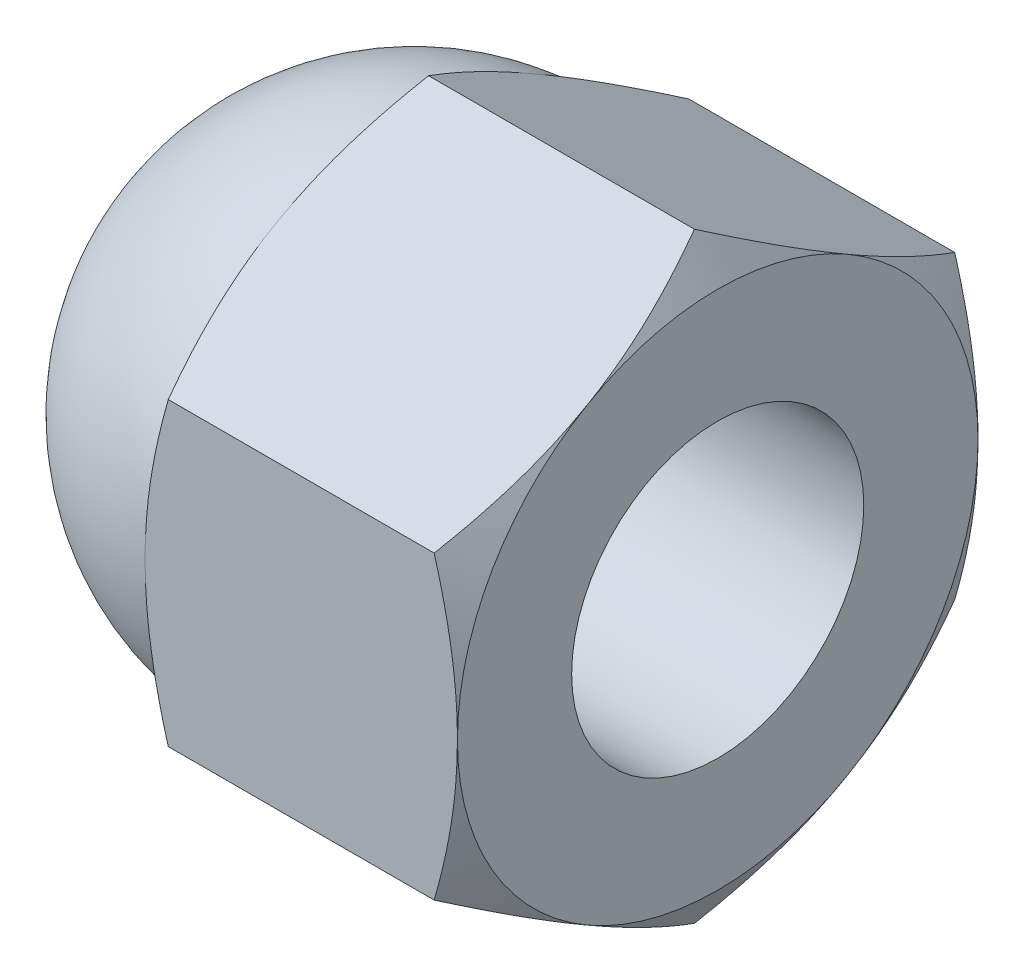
ISO-10303-21;
HEADER;
FILE_DESCRIPTION(('STEP AP214'),'2;1');
FILE_NAME('part.step','',(''),(''),'','','');
FILE_SCHEMA(('AUTOMOTIVE_DESIGN { 1 0 10303 214 1 1 1 1 }'));
ENDSEC;
DATA;
#1=APPLICATION_CONTEXT('core data for automotive mechanical design processes');
#2=APPLICATION_PROTOCOL_DEFINITION('international standard','automotive_design',2000,#1);
#3=PRODUCT_CONTEXT('',#1,'mechanical');
#4=PRODUCT('Part','Part','',(#3));
#5=PRODUCT_RELATED_PRODUCT_CATEGORY('part','',(#4));
#6=PRODUCT_DEFINITION_FORMATION('','',#4);
#7=PRODUCT_DEFINITION_CONTEXT('part definition',#1,'design');
#8=PRODUCT_DEFINITION('design','',#6,#7);
#9=PRODUCT_DEFINITION_SHAPE('','',#8);
#10=(LENGTH_UNIT() NAMED_UNIT(*) SI_UNIT(.MILLI.,.METRE.));
#11=(NAMED_UNIT(*) PLANE_ANGLE_UNIT() SI_UNIT($,.RADIAN.));
#12=(NAMED_UNIT(*) SI_UNIT($,.STERADIAN.) SOLID_ANGLE_UNIT());
#13=UNCERTAINTY_MEASURE_WITH_UNIT(LENGTH_MEASURE(1.E-05),#10,'distance_accuracy_value','');
#14=(GEOMETRIC_REPRESENTATION_CONTEXT(3) GLOBAL_UNCERTAINTY_ASSIGNED_CONTEXT((#13)) GLOBAL_UNIT_ASSIGNED_CONTEXT((#10,
#11,#12)) REPRESENTATION_CONTEXT('',''));
#15=CARTESIAN_POINT('',(0.,0.,0.));
#16=DIRECTION('',(0.,0.,1.));
#17=DIRECTION('',(1.,0.,0.));
#18=AXIS2_PLACEMENT_3D('',#15,#16,#17);
#19=CARTESIAN_POINT('',(-10.8,-5.19615242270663,9.));
#20=DIRECTION('',(0.,0.,1.));
#21=DIRECTION('',(0.,-1.,0.));
#22=AXIS2_PLACEMENT_3D('',#19,#20,#21);
#23=PLANE('',#22);
#24=CARTESIAN_POINT('',(-10.5,0.,9.));
#25=VERTEX_POINT('',#24);
#26=VERTEX_LOOP('',#25);
#27=FACE_BOUND('',#26,.T.);
#28=DIRECTION('',(1.,0.,0.));
#29=VECTOR('',#28,1.);
#30=CARTESIAN_POINT('',(-10.8,-5.19615242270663,9.));
#31=LINE('',#30,#29);
#32=CARTESIAN_POINT('',(-9.99615242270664,-5.19615242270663,9.));
#33=VERTEX_POINT('',#32);
#34=CARTESIAN_POINT('',(-0.803847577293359,-5.19615242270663,9.));
#35=VERTEX_POINT('',#34);
#36=EDGE_CURVE('E236',#33,#35,#31,.T.);
#37=ORIENTED_EDGE('',*,*,#36,.T.);
#38=CARTESIAN_POINT('',(-4.4134221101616,-14.0011345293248,9.));
#39=CARTESIAN_POINT('',(-4.22232611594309,-13.6075558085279,9.));
#40=CARTESIAN_POINT('',(-4.03305033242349,-13.2130780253,9.));
#41=CARTESIAN_POINT('',(-3.65916247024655,-12.421846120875,9.));
#42=CARTESIAN_POINT('',(-3.47455111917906,-12.0250916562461,9.));
#43=CARTESIAN_POINT('',(-3.11009664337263,-11.226806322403,9.));
#44=CARTESIAN_POINT('',(-2.93028454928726,-10.8252612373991,9.));
#45=CARTESIAN_POINT('',(-2.57796467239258,-10.0189911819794,9.));
#46=CARTESIAN_POINT('',(-2.40545654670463,-9.61426636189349,9.));
#47=CARTESIAN_POINT('',(-2.06431414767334,-8.78801484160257,9.));
#48=CARTESIAN_POINT('',(-1.89597894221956,-8.36636398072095,9.));
#49=CARTESIAN_POINT('',(-1.5719434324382,-7.51814721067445,9.));
#50=CARTESIAN_POINT('',(-1.41624453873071,-7.09158075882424,9.));
#51=CARTESIAN_POINT('',(-1.12153564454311,-6.23363207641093,9.));
#52=CARTESIAN_POINT('',(-0.982492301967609,-5.80226142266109,9.));
#53=CARTESIAN_POINT('',(-0.725524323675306,-4.93334937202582,9.));
#54=CARTESIAN_POINT('',(-0.607593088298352,-4.49580994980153,9.));
#55=CARTESIAN_POINT('',(-0.399083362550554,-3.61654683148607,9.));
#56=CARTESIAN_POINT('',(-0.308362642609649,-3.17485779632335,9.));
#57=CARTESIAN_POINT('',(-0.196624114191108,-2.50826884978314,9.));
#58=CARTESIAN_POINT('',(-0.163433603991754,-2.28538137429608,9.));
#59=CARTESIAN_POINT('',(-0.105816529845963,-1.83848377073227,9.));
#60=CARTESIAN_POINT('',(-0.0813891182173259,-1.6144737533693,9.));
#61=CARTESIAN_POINT('',(-0.0420936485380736,-1.1685777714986,9.));
#62=CARTESIAN_POINT('',(-0.0271042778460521,-0.946702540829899,9.));
#63=CARTESIAN_POINT('',(-0.00652388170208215,-0.502516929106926,9.));
#64=CARTESIAN_POINT('',(-0.000932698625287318,-0.280206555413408,9.));
#65=CARTESIAN_POINT('',(0.000717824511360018,0.164455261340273,9.));
#66=CARTESIAN_POINT('',(-0.00322301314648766,0.386806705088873,9.));
#67=CARTESIAN_POINT('',(-0.0205399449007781,0.831144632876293,9.));
#68=CARTESIAN_POINT('',(-0.0339165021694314,1.05313109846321,9.));
#69=CARTESIAN_POINT('',(-0.076994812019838,1.5851088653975,9.));
#70=CARTESIAN_POINT('',(-0.111088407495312,1.89475213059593,9.));
#71=CARTESIAN_POINT('',(-0.195786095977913,2.5117562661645,9.));
#72=CARTESIAN_POINT('',(-0.246392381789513,2.81911682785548,9.));
#73=CARTESIAN_POINT('',(-0.420297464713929,3.73739525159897,9.));
#74=CARTESIAN_POINT('',(-0.565653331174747,4.34419200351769,9.));
#75=CARTESIAN_POINT('',(-0.818016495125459,5.25198296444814,9.));
#76=CARTESIAN_POINT('',(-0.909110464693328,5.55767115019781,9.));
#77=CARTESIAN_POINT('',(-1.10081926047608,6.16607684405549,9.));
#78=CARTESIAN_POINT('',(-1.20143416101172,6.46879432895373,9.));
#79=CARTESIAN_POINT('',(-1.41056498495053,7.07135954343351,9.));
#80=CARTESIAN_POINT('',(-1.51907850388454,7.37120811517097,9.));
#81=CARTESIAN_POINT('',(-1.74272341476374,7.96841034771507,9.));
#82=CARTESIAN_POINT('',(-1.85785463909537,8.26576407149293,9.));
#83=CARTESIAN_POINT('',(-2.1875087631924,9.09420249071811,9.));
#84=CARTESIAN_POINT('',(-2.40816844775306,9.62284326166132,9.));
#85=CARTESIAN_POINT('',(-2.86247270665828,10.6745366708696,9.));
#86=CARTESIAN_POINT('',(-3.09611884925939,11.1975886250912,9.));
#87=CARTESIAN_POINT('',(-3.57318349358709,12.2394615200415,9.));
#88=CARTESIAN_POINT('',(-3.81660596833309,12.7582806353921,9.));
#89=CARTESIAN_POINT('',(-4.31078359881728,13.7923736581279,9.));
#90=CARTESIAN_POINT('',(-4.56153842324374,14.3076477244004,9.));
#91=CARTESIAN_POINT('',(-5.06914652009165,15.3362447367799,9.));
#92=CARTESIAN_POINT('',(-5.32600925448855,15.8495630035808,9.));
#93=CARTESIAN_POINT('',(-5.84421102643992,16.8739372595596,9.));
#94=CARTESIAN_POINT('',(-6.10555010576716,17.3849932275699,9.));
#95=CARTESIAN_POINT('',(-6.63173457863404,18.4051413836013,9.));
#96=CARTESIAN_POINT('',(-6.89657912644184,18.9142340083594,9.));
#97=CARTESIAN_POINT('',(-7.42915867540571,19.93090593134,9.));
#98=CARTESIAN_POINT('',(-7.69689368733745,20.4384852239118,8.99999999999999));
#99=CARTESIAN_POINT('',(-8.44379482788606,21.8465462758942,8.99999999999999));
#100=CARTESIAN_POINT('',(-8.92550336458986,22.7456791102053,8.99999999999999));
#101=CARTESIAN_POINT('',(-9.89429519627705,24.5411156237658,8.99999999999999));
#102=CARTESIAN_POINT('',(-10.3813788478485,25.4374191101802,8.99999999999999));
#103=CARTESIAN_POINT('',(-11.3578751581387,27.2248180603,8.99999999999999));
#104=CARTESIAN_POINT('',(-11.8472743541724,28.1159208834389,8.99999999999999));
#105=CARTESIAN_POINT('',(-12.5836208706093,29.4512869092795,8.99999999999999));
#106=CARTESIAN_POINT('',(-12.8294342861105,29.896176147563,8.99999999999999));
#107=CARTESIAN_POINT('',(-13.3217320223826,30.7855826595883,8.99999999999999));
#108=CARTESIAN_POINT('',(-13.5682163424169,31.2300999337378,9.));
#109=CARTESIAN_POINT('',(-13.8149939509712,31.6744543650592,9.));
#110=B_SPLINE_CURVE_WITH_KNOTS('',3,(#38,#39,#40,#41,#42,#43,#44,#45,#46,#47,#48,#49,#50,#51,
#52,#53,#54,#55,#56,#57,#58,#59,#60,#61,#62,#63,#64,#65,#66,#67,#68,#69,#70,#71,#72,#73,#74,#75,
#76,#77,#78,#79,#80,#81,#82,#83,#84,#85,#86,#87,#88,#89,#90,#91,#92,#93,#94,#95,#96,#97,#98,#99,
#100,#101,#102,#103,#104,#105,#106,#107,#108,#109),.UNSPECIFIED.,.F.,.F.,(4,2,2,2,2,2,2,2,2,2,2,
2,2,2,2,2,2,2,2,2,2,2,2,2,2,2,2,2,2,2,2,2,2,2,2,4),(0.,1.31256945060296,2.62534239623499,
3.94518469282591,5.26496496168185,6.62684143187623,7.98886972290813,9.3481241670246,
10.7069529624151,12.0585501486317,12.734440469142,13.4102653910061,14.077216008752,
14.744155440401,15.4111073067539,16.0780919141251,17.0121094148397,17.9462509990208,
19.815487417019,20.7723233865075,21.7291668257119,22.6857201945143,23.6422493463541,
25.3605176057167,27.0789938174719,28.7981756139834,30.5172798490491,32.2392474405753,
33.9612311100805,35.6828066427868,37.4043885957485,40.46448200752,43.5247796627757,
46.5747193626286,48.0995651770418,49.6244093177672),.UNSPECIFIED.);
#111=CARTESIAN_POINT('',(0.,0.,9.));
#112=VERTEX_POINT('',#111);
#113=EDGE_CURVE('E334',#35,#112,#110,.T.);
#114=ORIENTED_EDGE('',*,*,#113,.T.);
#115=CARTESIAN_POINT('',(-0.803847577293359,5.19615242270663,9.));
#116=VERTEX_POINT('',#115);
#117=EDGE_CURVE('E167',#112,#116,#110,.T.);
#118=ORIENTED_EDGE('',*,*,#117,.T.);
#119=DIRECTION('',(1.,0.,0.));
#120=VECTOR('',#119,1.);
#121=CARTESIAN_POINT('',(-10.8,5.19615242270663,9.));
#122=LINE('',#121,#120);
#123=CARTESIAN_POINT('',(-9.99615242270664,5.19615242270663,9.));
#124=VERTEX_POINT('',#123);
#125=EDGE_CURVE('E220',#124,#116,#122,.T.);
#126=ORIENTED_EDGE('',*,*,#125,.F.);
#127=CARTESIAN_POINT('',(-6.34439619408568,-14.0879095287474,9.));
#128=CARTESIAN_POINT('',(-6.53616569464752,-13.693655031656,9.));
#129=CARTESIAN_POINT('',(-6.72613358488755,-13.2985092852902,9.));
#130=CARTESIAN_POINT('',(-7.10145525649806,-12.5059616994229,9.));
#131=CARTESIAN_POINT('',(-7.28680833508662,-12.1085595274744,9.));
#132=CARTESIAN_POINT('',(-7.65279398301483,-11.3090404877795,9.));
#133=CARTESIAN_POINT('',(-7.83339647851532,-10.9069098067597,9.));
#134=CARTESIAN_POINT('',(-8.18738125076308,-10.0994948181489,9.));
#135=CARTESIAN_POINT('',(-8.36076386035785,-9.69421065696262,9.));
#136=CARTESIAN_POINT('',(-8.70398931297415,-8.86637898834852,9.));
#137=CARTESIAN_POINT('',(-8.87352564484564,-8.44370370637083,9.));
#138=CARTESIAN_POINT('',(-9.20008012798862,-7.59345787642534,9.));
#139=CARTESIAN_POINT('',(-9.35709689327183,-7.16588679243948,9.));
#140=CARTESIAN_POINT('',(-9.65458596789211,-6.305922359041,9.));
#141=CARTESIAN_POINT('',(-9.7950906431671,-5.87354032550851,9.));
#142=CARTESIAN_POINT('',(-10.0551354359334,-5.00259089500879,9.));
#143=CARTESIAN_POINT('',(-10.1746820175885,-4.56402545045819,9.));
#144=CARTESIAN_POINT('',(-10.3865251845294,-3.68279147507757,9.));
#145=CARTESIAN_POINT('',(-10.478970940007,-3.24015978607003,9.));
#146=CARTESIAN_POINT('',(-10.5933665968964,-2.5720797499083,9.));
#147=CARTESIAN_POINT('',(-10.6274544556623,-2.34868256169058,9.));
#148=CARTESIAN_POINT('',(-10.6868739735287,-1.90073399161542,9.));
#149=CARTESIAN_POINT('',(-10.71220648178,-1.67618272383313,9.));
#150=CARTESIAN_POINT('',(-10.753285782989,-1.22921881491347,9.));
#151=CARTESIAN_POINT('',(-10.7691558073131,-1.00681754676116,9.));
#152=CARTESIAN_POINT('',(-10.7914704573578,-0.561542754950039,9.));
#153=CARTESIAN_POINT('',(-10.7979152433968,-0.338669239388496,9.));
#154=CARTESIAN_POINT('',(-10.8012251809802,0.107152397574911,9.));
#155=CARTESIAN_POINT('',(-10.7980902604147,0.330100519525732,9.));
#156=CARTESIAN_POINT('',(-10.7823189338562,0.775663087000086,9.));
#157=CARTESIAN_POINT('',(-10.7696820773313,0.99827751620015,9.));
#158=CARTESIAN_POINT('',(-10.7284769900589,1.52928538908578,9.));
#159=CARTESIAN_POINT('',(-10.695623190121,1.83735365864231,9.));
#160=CARTESIAN_POINT('',(-10.6134808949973,2.45127496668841,9.));
#161=CARTESIAN_POINT('',(-10.5641902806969,2.75712771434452,9.));
#162=CARTESIAN_POINT('',(-10.3942711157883,3.6709642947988,9.));
#163=CARTESIAN_POINT('',(-10.2516229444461,4.27491194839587,9.));
#164=CARTESIAN_POINT('',(-10.0032990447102,5.17834875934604,9.));
#165=CARTESIAN_POINT('',(-9.913584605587,5.48249505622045,9.));
#166=CARTESIAN_POINT('',(-9.72460437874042,6.08783493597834,9.));
#167=CARTESIAN_POINT('',(-9.62533851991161,6.38902849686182,9.));
#168=CARTESIAN_POINT('',(-9.41886770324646,6.98855625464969,9.));
#169=CARTESIAN_POINT('',(-9.31166511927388,7.28689127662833,9.));
#170=CARTESIAN_POINT('',(-9.09060569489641,7.88107084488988,9.));
#171=CARTESIAN_POINT('',(-8.97674899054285,8.17691544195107,9.));
#172=CARTESIAN_POINT('',(-8.66908665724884,8.95441621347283,9.));
#173=CARTESIAN_POINT('',(-8.47061022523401,9.43422210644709,9.));
#174=CARTESIAN_POINT('',(-8.06247010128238,10.389068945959,9.));
#175=CARTESIAN_POINT('',(-7.85280529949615,10.864109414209,9.));
#176=CARTESIAN_POINT('',(-7.42486425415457,11.8104820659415,9.));
#177=CARTESIAN_POINT('',(-7.20658504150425,12.2818129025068,9.));
#178=CARTESIAN_POINT('',(-6.76341771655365,13.2213264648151,9.));
#179=CARTESIAN_POINT('',(-6.53852984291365,13.689509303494,9.));
#180=CARTESIAN_POINT('',(-6.08320833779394,14.6240308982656,9.));
#181=CARTESIAN_POINT('',(-5.85276692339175,15.0903658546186,9.));
#182=CARTESIAN_POINT('',(-5.38771687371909,16.020954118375,9.));
#183=CARTESIAN_POINT('',(-5.15310820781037,16.4852074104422,9.));
#184=CARTESIAN_POINT('',(-4.68057121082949,17.411902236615,9.));
#185=CARTESIAN_POINT('',(-4.44264355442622,17.8743441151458,9.));
#186=CARTESIAN_POINT('',(-3.96402956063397,18.7977988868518,9.));
#187=CARTESIAN_POINT('',(-3.72334321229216,19.2588117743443,9.));
#188=CARTESIAN_POINT('',(-3.04699164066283,20.5465513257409,9.));
#189=CARTESIAN_POINT('',(-2.60879583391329,21.3719486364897,8.99999999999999));
#190=CARTESIAN_POINT('',(-1.72705096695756,23.0199314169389,8.99999999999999));
#191=CARTESIAN_POINT('',(-1.28350160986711,23.8425167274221,8.99999999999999));
#192=CARTESIAN_POINT('',(-0.393801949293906,25.4829119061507,8.99999999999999));
#193=CARTESIAN_POINT('',(0.0523356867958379,26.3007286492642,8.99999999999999));
#194=CARTESIAN_POINT('',(0.723826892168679,27.5261617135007,8.99999999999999));
#195=CARTESIAN_POINT('',(0.948029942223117,27.9344093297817,8.99999999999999));
#196=CARTESIAN_POINT('',(1.39711875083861,28.7505282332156,8.99999999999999));
#197=CARTESIAN_POINT('',(1.62200450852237,29.1583995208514,9.));
#198=CARTESIAN_POINT('',(1.84718982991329,29.5661053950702,9.));
#199=B_SPLINE_CURVE_WITH_KNOTS('',3,(#127,#128,#129,#130,#131,#132,#133,#134,#135,#136,#137,
#138,#139,#140,#141,#142,#143,#144,#145,#146,#147,#148,#149,#150,#151,#152,#153,#154,#155,#156,
#157,#158,#159,#160,#161,#162,#163,#164,#165,#166,#167,#168,#169,#170,#171,#172,#173,#174,#175,
#176,#177,#178,#179,#180,#181,#182,#183,#184,#185,#186,#187,#188,#189,#190,#191,#192,#193,#194,
#195,#196,#197,#198),.UNSPECIFIED.,.F.,.F.,(4,2,2,2,2,2,2,2,2,2,2,2,2,2,2,2,2,2,2,2,2,2,2,2,2,2,
2,2,2,2,2,2,2,2,2,4),(0.,1.31527562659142,2.63075034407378,3.95316726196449,5.27552314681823,
6.64159484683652,8.0078175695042,9.37131599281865,10.7343931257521,12.0898202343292,
12.7676245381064,13.445363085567,14.1140707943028,14.7827671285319,15.4514684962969,
16.1202015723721,17.0491251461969,17.9781685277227,19.8371982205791,20.7884210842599,
21.7396510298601,22.6905976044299,23.6415247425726,25.1990257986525,26.7566816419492,
28.3148791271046,29.8730204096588,31.4334894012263,32.993969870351,34.5541376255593,
36.1143115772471,38.9177907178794,41.7214260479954,44.5161918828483,45.9134738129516,
47.3107539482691),.UNSPECIFIED.);
#200=CARTESIAN_POINT('',(-10.8,0.,9.));
#201=VERTEX_POINT('',#200);
#202=EDGE_CURVE('E290',#124,#201,#199,.F.);
#203=ORIENTED_EDGE('',*,*,#202,.T.);
#204=EDGE_CURVE('E286',#201,#33,#199,.F.);
#205=ORIENTED_EDGE('',*,*,#204,.T.);
#206=EDGE_LOOP('',(#37,#114,#118,#126,#203,#205));
#207=FACE_BOUND('',#206,.T.);
#208=ADVANCED_FACE('F17',(#27,#207),#23,.T.);
#209=CARTESIAN_POINT('',(-10.8,5.19615242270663,9.));
#210=DIRECTION('',(0.,0.866025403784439,0.5));
#211=DIRECTION('',(0.,-0.5,0.866025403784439));
#212=AXIS2_PLACEMENT_3D('',#209,#210,#211);
#213=PLANE('',#212);
#214=CARTESIAN_POINT('',(-10.5,7.79422863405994,4.5));
#215=VERTEX_POINT('',#214);
#216=VERTEX_LOOP('',#215);
#217=FACE_BOUND('',#216,.T.);
#218=ORIENTED_EDGE('',*,*,#125,.T.);
#219=CARTESIAN_POINT('',(-0.803914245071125,5.19603695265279,9.0002));
#220=CARTESIAN_POINT('',(-0.73798200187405,5.31024090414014,8.80239295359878));
#221=CARTESIAN_POINT('',(-0.67504140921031,5.42489028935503,8.60381439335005));
#222=CARTESIAN_POINT('',(-0.555968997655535,5.65512011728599,8.20504463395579));
#223=CARTESIAN_POINT('',(-0.499840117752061,5.77070093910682,8.00485277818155));
#224=CARTESIAN_POINT('',(-0.39515196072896,6.00300811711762,7.6024849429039));
#225=CARTESIAN_POINT('',(-0.346610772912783,6.11973652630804,7.4003054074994));
#226=CARTESIAN_POINT('',(-0.258148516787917,6.35398725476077,6.99457124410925));
#227=CARTESIAN_POINT('',(-0.218225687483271,6.47150940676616,6.79101690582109));
#228=CARTESIAN_POINT('',(-0.148684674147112,6.70436794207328,6.38769409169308));
#229=CARTESIAN_POINT('',(-0.118837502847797,6.81968712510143,6.18795540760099));
#230=CARTESIAN_POINT('',(-0.0687933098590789,7.05084147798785,5.787584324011));
#231=CARTESIAN_POINT('',(-0.0485954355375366,7.16667660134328,5.58695200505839));
#232=CARTESIAN_POINT('',(-0.0183543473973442,7.39854776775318,5.18533936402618));
#233=CARTESIAN_POINT('',(-0.00829960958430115,7.51458343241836,4.98435969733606));
#234=CARTESIAN_POINT('',(0.00143766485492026,7.74676155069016,4.58221540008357));
#235=CARTESIAN_POINT('',(0.00112052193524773,7.86290400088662,4.38105077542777));
#236=CARTESIAN_POINT('',(-0.00916395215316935,8.08003584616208,4.00496738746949));
#237=CARTESIAN_POINT('',(-0.0178767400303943,8.18104055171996,3.8300221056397));
#238=CARTESIAN_POINT('',(-0.0429773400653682,8.38281337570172,3.48054132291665));
#239=CARTESIAN_POINT('',(-0.0593656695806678,8.4835814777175,3.30600585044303));
#240=CARTESIAN_POINT('',(-0.119656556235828,8.7854956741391,2.78307512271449));
#241=CARTESIAN_POINT('',(-0.174677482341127,8.98610736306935,2.43560548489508));
#242=CARTESIAN_POINT('',(-0.31223047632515,9.38945876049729,1.736980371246));
#243=CARTESIAN_POINT('',(-0.395345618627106,9.59214699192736,1.38591405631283));
#244=CARTESIAN_POINT('',(-0.58398253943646,9.99450087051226,0.689016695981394));
#245=CARTESIAN_POINT('',(-0.689460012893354,10.1941716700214,0.343176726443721));
#246=CARTESIAN_POINT('',(-0.803914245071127,10.3924203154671,-0.000199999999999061));
#247=B_SPLINE_CURVE_WITH_KNOTS('',3,(#219,#220,#221,#222,#223,#224,#225,#226,#227,#228,#229,
#230,#231,#232,#233,#234,#235,#236,#237,#238,#239,#240,#241,#242,#243,#244,#245,#246),
.UNSPECIFIED.,.F.,.F.,(4,2,2,2,2,2,2,2,2,2,2,2,2,4),(0.,0.713219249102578,1.42674513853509,
2.14194697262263,2.85700253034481,3.55449749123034,4.25193080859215,4.94857085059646,
5.64518936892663,6.25162976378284,6.85811104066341,8.07193747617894,9.31268391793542,
10.5509947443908),.UNSPECIFIED.);
#248=CARTESIAN_POINT('',(0.,7.79422863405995,4.5));
#249=VERTEX_POINT('',#248);
#250=EDGE_CURVE('E333',#116,#249,#247,.T.);
#251=ORIENTED_EDGE('',*,*,#250,.T.);
#252=CARTESIAN_POINT('',(-0.803847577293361,10.3923048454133,0.));
#253=VERTEX_POINT('',#252);
#254=EDGE_CURVE('E190',#249,#253,#247,.T.);
#255=ORIENTED_EDGE('',*,*,#254,.T.);
#256=DIRECTION('',(1.,0.,0.));
#257=VECTOR('',#256,1.);
#258=CARTESIAN_POINT('',(-10.8,10.3923048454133,0.));
#259=LINE('',#258,#257);
#260=CARTESIAN_POINT('',(-9.99615242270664,10.3923048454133,0.));
#261=VERTEX_POINT('',#260);
#262=EDGE_CURVE('E224',#261,#253,#259,.T.);
#263=ORIENTED_EDGE('',*,*,#262,.F.);
#264=CARTESIAN_POINT('',(-9.99608575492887,10.3924203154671,-0.000199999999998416));
#265=CARTESIAN_POINT('',(-10.0620179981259,10.2782163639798,0.197607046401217));
#266=CARTESIAN_POINT('',(-10.1249585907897,10.1635669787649,0.396185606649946));
#267=CARTESIAN_POINT('',(-10.2440310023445,9.9333371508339,0.794955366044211));
#268=CARTESIAN_POINT('',(-10.3001598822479,9.81775632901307,0.995147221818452));
#269=CARTESIAN_POINT('',(-10.404848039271,9.58544915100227,1.3975150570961));
#270=CARTESIAN_POINT('',(-10.4533892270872,9.46872074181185,1.5996945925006));
#271=CARTESIAN_POINT('',(-10.5418514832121,9.23447001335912,2.00542875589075));
#272=CARTESIAN_POINT('',(-10.5817743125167,9.11694786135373,2.20898309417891));
#273=CARTESIAN_POINT('',(-10.6513153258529,8.88408932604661,2.61230590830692));
#274=CARTESIAN_POINT('',(-10.6811624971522,8.76877014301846,2.81204459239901));
#275=CARTESIAN_POINT('',(-10.7312066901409,8.53761579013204,3.212415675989));
#276=CARTESIAN_POINT('',(-10.7514045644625,8.42178066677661,3.41304799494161));
#277=CARTESIAN_POINT('',(-10.7816456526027,8.1899095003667,3.81466063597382));
#278=CARTESIAN_POINT('',(-10.7917003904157,8.07387383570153,4.01564030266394));
#279=CARTESIAN_POINT('',(-10.8014376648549,7.84169571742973,4.41778459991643));
#280=CARTESIAN_POINT('',(-10.8011205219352,7.72555326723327,4.61894922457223));
#281=CARTESIAN_POINT('',(-10.7908360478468,7.50842142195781,4.99503261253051));
#282=CARTESIAN_POINT('',(-10.7821232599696,7.40741671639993,5.1699778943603));
#283=CARTESIAN_POINT('',(-10.7570226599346,7.20564389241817,5.51945867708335));
#284=CARTESIAN_POINT('',(-10.7406343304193,7.10487579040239,5.69399414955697));
#285=CARTESIAN_POINT('',(-10.6803434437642,6.80296159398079,6.21692487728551));
#286=CARTESIAN_POINT('',(-10.6253225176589,6.60234990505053,6.56439451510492));
#287=CARTESIAN_POINT('',(-10.4877695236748,6.1989985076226,7.263019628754));
#288=CARTESIAN_POINT('',(-10.4046543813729,5.99631027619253,7.61408594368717));
#289=CARTESIAN_POINT('',(-10.2160174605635,5.59395639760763,8.31098330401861));
#290=CARTESIAN_POINT('',(-10.1105399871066,5.39428559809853,8.65682327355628));
#291=CARTESIAN_POINT('',(-9.99608575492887,5.19603695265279,9.0002));
#292=B_SPLINE_CURVE_WITH_KNOTS('',3,(#264,#265,#266,#267,#268,#269,#270,#271,#272,#273,#274,
#275,#276,#277,#278,#279,#280,#281,#282,#283,#284,#285,#286,#287,#288,#289,#290,#291),
.UNSPECIFIED.,.F.,.F.,(4,2,2,2,2,2,2,2,2,2,2,2,2,4),(0.,0.713219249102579,1.42674513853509,
2.14194697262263,2.85700253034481,3.55449749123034,4.25193080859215,4.94857085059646,
5.64518936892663,6.25162976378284,6.85811104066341,8.07193747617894,9.31268391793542,
10.5509947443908),.UNSPECIFIED.);
#293=CARTESIAN_POINT('',(-10.8,7.79422863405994,4.5));
#294=VERTEX_POINT('',#293);
#295=EDGE_CURVE('E319',#261,#294,#292,.T.);
#296=ORIENTED_EDGE('',*,*,#295,.T.);
#297=EDGE_CURVE('E215',#294,#124,#292,.T.);
#298=ORIENTED_EDGE('',*,*,#297,.T.);
#299=EDGE_LOOP('',(#218,#251,#255,#263,#296,#298));
#300=FACE_BOUND('',#299,.T.);
#301=ADVANCED_FACE('F199',(#217,#300),#213,.T.);
#302=CARTESIAN_POINT('',(-10.8,10.3923048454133,0.));
#303=DIRECTION('',(0.,0.866025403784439,-0.5));
#304=DIRECTION('',(0.,0.5,0.866025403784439));
#305=AXIS2_PLACEMENT_3D('',#302,#303,#304);
#306=PLANE('',#305);
#307=CARTESIAN_POINT('',(-10.5,7.79422863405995,-4.5));
#308=VERTEX_POINT('',#307);
#309=VERTEX_LOOP('',#308);
#310=FACE_BOUND('',#309,.T.);
#311=ORIENTED_EDGE('',*,*,#262,.T.);
#312=CARTESIAN_POINT('',(-0.803914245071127,10.3924203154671,0.000200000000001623));
#313=CARTESIAN_POINT('',(-0.73798200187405,10.2782163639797,-0.197607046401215));
#314=CARTESIAN_POINT('',(-0.675041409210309,10.1635669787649,-0.396185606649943));
#315=CARTESIAN_POINT('',(-0.555968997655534,9.9333371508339,-0.794955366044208));
#316=CARTESIAN_POINT('',(-0.49984011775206,9.81775632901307,-0.995147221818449));
#317=CARTESIAN_POINT('',(-0.395151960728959,9.58544915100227,-1.3975150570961));
#318=CARTESIAN_POINT('',(-0.346610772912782,9.46872074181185,-1.5996945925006));
#319=CARTESIAN_POINT('',(-0.258148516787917,9.23447001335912,-2.00542875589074));
#320=CARTESIAN_POINT('',(-0.218225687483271,9.11694786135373,-2.20898309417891));
#321=CARTESIAN_POINT('',(-0.148684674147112,8.88408932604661,-2.61230590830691));
#322=CARTESIAN_POINT('',(-0.118837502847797,8.76877014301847,-2.812044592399));
#323=CARTESIAN_POINT('',(-0.0687933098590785,8.53761579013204,-3.21241567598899));
#324=CARTESIAN_POINT('',(-0.0485954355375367,8.42178066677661,-3.4130479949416));
#325=CARTESIAN_POINT('',(-0.0183543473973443,8.18990950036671,-3.81466063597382));
#326=CARTESIAN_POINT('',(-0.0082996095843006,8.07387383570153,-4.01564030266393));
#327=CARTESIAN_POINT('',(0.00143766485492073,7.84169571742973,-4.41778459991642));
#328=CARTESIAN_POINT('',(0.0011205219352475,7.72555326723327,-4.61894922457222));
#329=CARTESIAN_POINT('',(-0.0091639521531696,7.50842142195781,-4.9950326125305));
#330=CARTESIAN_POINT('',(-0.017876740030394,7.40741671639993,-5.16997789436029));
#331=CARTESIAN_POINT('',(-0.0429773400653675,7.20564389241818,-5.51945867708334));
#332=CARTESIAN_POINT('',(-0.0593656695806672,7.10487579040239,-5.69399414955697));
#333=CARTESIAN_POINT('',(-0.119656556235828,6.80296159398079,-6.2169248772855));
#334=CARTESIAN_POINT('',(-0.174677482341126,6.60234990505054,-6.56439451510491));
#335=CARTESIAN_POINT('',(-0.31223047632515,6.1989985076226,-7.263019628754));
#336=CARTESIAN_POINT('',(-0.395345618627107,5.99631027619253,-7.61408594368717));
#337=CARTESIAN_POINT('',(-0.583982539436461,5.59395639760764,-8.3109833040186));
#338=CARTESIAN_POINT('',(-0.689460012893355,5.39428559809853,-8.65682327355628));
#339=CARTESIAN_POINT('',(-0.803914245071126,5.19603695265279,-9.0002));
#340=B_SPLINE_CURVE_WITH_KNOTS('',3,(#312,#313,#314,#315,#316,#317,#318,#319,#320,#321,#322,
#323,#324,#325,#326,#327,#328,#329,#330,#331,#332,#333,#334,#335,#336,#337,#338,#339),
.UNSPECIFIED.,.F.,.F.,(4,2,2,2,2,2,2,2,2,2,2,2,2,4),(0.,0.713219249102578,1.42674513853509,
2.14194697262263,2.8570025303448,3.55449749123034,4.25193080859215,4.94857085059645,
5.64518936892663,6.25162976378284,6.8581110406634,8.07193747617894,9.31268391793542,
10.5509947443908),.UNSPECIFIED.);
#341=CARTESIAN_POINT('',(0.,7.79422863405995,-4.5));
#342=VERTEX_POINT('',#341);
#343=EDGE_CURVE('E188',#253,#342,#340,.T.);
#344=ORIENTED_EDGE('',*,*,#343,.T.);
#345=CARTESIAN_POINT('',(-0.803847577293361,5.19615242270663,-9.));
#346=VERTEX_POINT('',#345);
#347=EDGE_CURVE('E182',#342,#346,#340,.T.);
#348=ORIENTED_EDGE('',*,*,#347,.T.);
#349=DIRECTION('',(1.,0.,0.));
#350=VECTOR('',#349,1.);
#351=CARTESIAN_POINT('',(-10.8,5.19615242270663,-9.));
#352=LINE('',#351,#350);
#353=CARTESIAN_POINT('',(-9.99615242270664,5.19615242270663,-9.));
#354=VERTEX_POINT('',#353);
#355=EDGE_CURVE('E227',#354,#346,#352,.T.);
#356=ORIENTED_EDGE('',*,*,#355,.F.);
#357=CARTESIAN_POINT('',(-9.99608575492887,5.19603695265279,-9.0002));
#358=CARTESIAN_POINT('',(-10.0620179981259,5.31024090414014,-8.80239295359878));
#359=CARTESIAN_POINT('',(-10.1249585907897,5.42489028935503,-8.60381439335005));
#360=CARTESIAN_POINT('',(-10.2440310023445,5.65512011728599,-8.20504463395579));
#361=CARTESIAN_POINT('',(-10.3001598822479,5.77070093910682,-8.00485277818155));
#362=CARTESIAN_POINT('',(-10.404848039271,6.00300811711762,-7.6024849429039));
#363=CARTESIAN_POINT('',(-10.4533892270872,6.11973652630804,-7.4003054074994));
#364=CARTESIAN_POINT('',(-10.5418514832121,6.35398725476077,-6.99457124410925));
#365=CARTESIAN_POINT('',(-10.5817743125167,6.47150940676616,-6.79101690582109));
#366=CARTESIAN_POINT('',(-10.6513153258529,6.70436794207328,-6.38769409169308));
#367=CARTESIAN_POINT('',(-10.6811624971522,6.81968712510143,-6.18795540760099));
#368=CARTESIAN_POINT('',(-10.7312066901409,7.05084147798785,-5.787584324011));
#369=CARTESIAN_POINT('',(-10.7514045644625,7.16667660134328,-5.58695200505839));
#370=CARTESIAN_POINT('',(-10.7816456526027,7.39854776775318,-5.18533936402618));
#371=CARTESIAN_POINT('',(-10.7917003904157,7.51458343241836,-4.98435969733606));
#372=CARTESIAN_POINT('',(-10.8014376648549,7.74676155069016,-4.58221540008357));
#373=CARTESIAN_POINT('',(-10.8011205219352,7.86290400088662,-4.38105077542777));
#374=CARTESIAN_POINT('',(-10.7908360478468,8.08003584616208,-4.00496738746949));
#375=CARTESIAN_POINT('',(-10.7821232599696,8.18104055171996,-3.8300221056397));
#376=CARTESIAN_POINT('',(-10.7570226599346,8.38281337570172,-3.48054132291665));
#377=CARTESIAN_POINT('',(-10.7406343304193,8.4835814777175,-3.30600585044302));
#378=CARTESIAN_POINT('',(-10.6803434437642,8.7854956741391,-2.78307512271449));
#379=CARTESIAN_POINT('',(-10.6253225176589,8.98610736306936,-2.43560548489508));
#380=CARTESIAN_POINT('',(-10.4877695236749,9.38945876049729,-1.736980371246));
#381=CARTESIAN_POINT('',(-10.4046543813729,9.59214699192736,-1.38591405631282));
#382=CARTESIAN_POINT('',(-10.2160174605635,9.99450087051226,-0.689016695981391));
#383=CARTESIAN_POINT('',(-10.1105399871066,10.1941716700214,-0.343176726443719));
#384=CARTESIAN_POINT('',(-9.99608575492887,10.3924203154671,0.000200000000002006));
#385=B_SPLINE_CURVE_WITH_KNOTS('',3,(#357,#358,#359,#360,#361,#362,#363,#364,#365,#366,#367,
#368,#369,#370,#371,#372,#373,#374,#375,#376,#377,#378,#379,#380,#381,#382,#383,#384),
.UNSPECIFIED.,.F.,.F.,(4,2,2,2,2,2,2,2,2,2,2,2,2,4),(0.,0.713219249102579,1.42674513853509,
2.14194697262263,2.85700253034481,3.55449749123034,4.25193080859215,4.94857085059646,
5.64518936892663,6.25162976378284,6.85811104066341,8.07193747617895,9.31268391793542,
10.5509947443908),.UNSPECIFIED.);
#386=CARTESIAN_POINT('',(-10.8,7.79422863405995,-4.5));
#387=VERTEX_POINT('',#386);
#388=EDGE_CURVE('E213',#354,#387,#385,.T.);
#389=ORIENTED_EDGE('',*,*,#388,.T.);
#390=EDGE_CURVE('E206',#387,#261,#385,.T.);
#391=ORIENTED_EDGE('',*,*,#390,.T.);
#392=EDGE_LOOP('',(#311,#344,#348,#356,#389,#391));
#393=FACE_BOUND('',#392,.T.);
#394=ADVANCED_FACE('F195',(#310,#393),#306,.T.);
#395=CARTESIAN_POINT('',(-10.8,5.19615242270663,-9.));
#396=DIRECTION('',(0.,0.,-1.));
#397=DIRECTION('',(-1.,0.,0.));
#398=AXIS2_PLACEMENT_3D('',#395,#396,#397);
#399=PLANE('',#398);
#400=CARTESIAN_POINT('',(-10.5,0.,-9.));
#401=VERTEX_POINT('',#400);
#402=VERTEX_LOOP('',#401);
#403=FACE_BOUND('',#402,.T.);
#404=ORIENTED_EDGE('',*,*,#355,.T.);
#405=CARTESIAN_POINT('',(-4.41342210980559,-14.0011345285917,-9.));
#406=CARTESIAN_POINT('',(-4.22232611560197,-13.6075558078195,-9.));
#407=CARTESIAN_POINT('',(-4.03305033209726,-13.2130780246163,-9.));
#408=CARTESIAN_POINT('',(-3.65916246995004,-12.4218461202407,-9.));
#409=CARTESIAN_POINT('',(-3.47455111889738,-12.0250916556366,-9.));
#410=CARTESIAN_POINT('',(-3.1100966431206,-11.2268063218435,-9.));
#411=CARTESIAN_POINT('',(-2.93028454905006,-10.8252612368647,-9.));
#412=CARTESIAN_POINT('',(-2.57796467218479,-10.0189911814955,-9.));
#413=CARTESIAN_POINT('',(-2.40545654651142,-9.61426636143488,-9.));
#414=CARTESIAN_POINT('',(-2.06431414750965,-8.78801484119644,-9.));
#415=CARTESIAN_POINT('',(-1.89597894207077,-8.366363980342,-9.));
#416=CARTESIAN_POINT('',(-1.5719434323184,-7.51814721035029,-9.));
#417=CARTESIAN_POINT('',(-1.416244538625,-7.0915807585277,-9.));
#418=CARTESIAN_POINT('',(-1.12153564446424,-6.23363207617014,-9.));
#419=CARTESIAN_POINT('',(-0.982492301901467,-5.80226142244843,-9.));
#420=CARTESIAN_POINT('',(-0.725524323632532,-4.93334937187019,-9.));
#421=CARTESIAN_POINT('',(-0.607593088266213,-4.49580994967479,-9.));
#422=CARTESIAN_POINT('',(-0.399083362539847,-3.61654683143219,-9.));
#423=CARTESIAN_POINT('',(-0.308362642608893,-3.17485779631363,-9.));
#424=CARTESIAN_POINT('',(-0.196624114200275,-2.50826884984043,-9.));
#425=CARTESIAN_POINT('',(-0.163433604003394,-2.28538137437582,-9.));
#426=CARTESIAN_POINT('',(-0.105816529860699,-1.8384837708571,-9.));
#427=CARTESIAN_POINT('',(-0.0813891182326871,-1.61447375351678,-9.));
#428=CARTESIAN_POINT('',(-0.042093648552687,-1.16857777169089,-9.));
#429=CARTESIAN_POINT('',(-0.0271042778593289,-0.946702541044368,-9.));
#430=CARTESIAN_POINT('',(-0.00652388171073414,-0.502516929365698,-9.));
#431=CARTESIAN_POINT('',(-0.000932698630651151,-0.280206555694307,-9.));
#432=CARTESIAN_POINT('',(0.000717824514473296,0.164455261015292,-9.));
#433=CARTESIAN_POINT('',(-0.00322301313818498,0.386806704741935,-9.));
#434=CARTESIAN_POINT('',(-0.020539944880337,0.831144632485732,-9.));
#435=CARTESIAN_POINT('',(-0.0339165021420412,1.05313109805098,-9.));
#436=CARTESIAN_POINT('',(-0.0769948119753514,1.58510886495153,-9.));
#437=CARTESIAN_POINT('',(-0.111088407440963,1.89475213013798,-9.));
#438=CARTESIAN_POINT('',(-0.195786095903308,2.51175626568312,-9.));
#439=CARTESIAN_POINT('',(-0.246392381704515,2.81911682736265,-9.));
#440=CARTESIAN_POINT('',(-0.420297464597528,3.73739525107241,-9.));
#441=CARTESIAN_POINT('',(-0.565653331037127,4.3441920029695,-9.));
#442=CARTESIAN_POINT('',(-0.818016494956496,5.25198296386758,-9.));
#443=CARTESIAN_POINT('',(-0.909110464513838,5.55767114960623,-9.));
#444=CARTESIAN_POINT('',(-1.10081926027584,6.16607684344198,-9.));
#445=CARTESIAN_POINT('',(-1.20143416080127,6.46879432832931,-9.));
#446=CARTESIAN_POINT('',(-1.41056498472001,7.07135954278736,-9.));
#447=CARTESIAN_POINT('',(-1.51907850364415,7.37120811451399,-9.));
#448=CARTESIAN_POINT('',(-1.74272341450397,7.96841034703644,-9.));
#449=CARTESIAN_POINT('',(-1.85785463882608,8.26576407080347,-9.));
#450=CARTESIAN_POINT('',(-2.18750876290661,9.09420249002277,-9.));
#451=CARTESIAN_POINT('',(-2.40816844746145,9.62284326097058,-9.));
#452=CARTESIAN_POINT('',(-2.86247270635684,10.6745366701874,-9.));
#453=CARTESIAN_POINT('',(-3.09611884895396,11.197588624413,-9.));
#454=CARTESIAN_POINT('',(-3.57318349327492,12.2394615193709,-9.));
#455=CARTESIAN_POINT('',(-3.8166059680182,12.758280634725,-9.));
#456=CARTESIAN_POINT('',(-4.31078359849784,13.7923736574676,-9.));
#457=CARTESIAN_POINT('',(-4.56153842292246,14.3076477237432,-9.));
#458=CARTESIAN_POINT('',(-5.06914651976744,15.336244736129,-9.));
#459=CARTESIAN_POINT('',(-5.32600925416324,15.849563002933,-9.));
#460=CARTESIAN_POINT('',(-5.84421102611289,16.8739372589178,-9.));
#461=CARTESIAN_POINT('',(-6.10555010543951,17.384993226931,-9.));
#462=CARTESIAN_POINT('',(-6.63173457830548,18.405141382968,-9.));
#463=CARTESIAN_POINT('',(-6.89657912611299,18.9142340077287,-9.));
#464=CARTESIAN_POINT('',(-7.42915867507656,19.9309059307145,-9.));
#465=CARTESIAN_POINT('',(-7.69689368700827,20.4384852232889,-9.));
#466=CARTESIAN_POINT('',(-8.4437948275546,21.8465462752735,-9.));
#467=CARTESIAN_POINT('',(-8.92550336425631,22.7456791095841,-9.));
#468=CARTESIAN_POINT('',(-9.89429519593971,24.5411156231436,-9.));
#469=CARTESIAN_POINT('',(-10.3813788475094,25.4374191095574,-9.));
#470=CARTESIAN_POINT('',(-11.3578751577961,27.2248180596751,-9.));
#471=CARTESIAN_POINT('',(-11.847274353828,28.1159208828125,-9.));
#472=CARTESIAN_POINT('',(-12.5836208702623,29.4512869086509,-9.));
#473=CARTESIAN_POINT('',(-12.8294342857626,29.8961761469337,-9.));
#474=CARTESIAN_POINT('',(-13.321732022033,30.7855826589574,-9.));
#475=CARTESIAN_POINT('',(-13.5682163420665,31.2300999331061,-9.));
#476=CARTESIAN_POINT('',(-13.8149939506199,31.6744543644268,-9.));
#477=B_SPLINE_CURVE_WITH_KNOTS('',3,(#405,#406,#407,#408,#409,#410,#411,#412,#413,#414,#415,
#416,#417,#418,#419,#420,#421,#422,#423,#424,#425,#426,#427,#428,#429,#430,#431,#432,#433,#434,
#435,#436,#437,#438,#439,#440,#441,#442,#443,#444,#445,#446,#447,#448,#449,#450,#451,#452,#453,
#454,#455,#456,#457,#458,#459,#460,#461,#462,#463,#464,#465,#466,#467,#468,#469,#470,#471,#472,
#473,#474,#475,#476),.UNSPECIFIED.,.F.,.F.,(4,2,2,2,2,2,2,2,2,2,2,2,2,2,2,2,2,2,2,2,2,2,2,2,2,2,
2,2,2,2,2,2,2,2,2,4),(0.,1.31256945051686,2.62534239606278,3.94518469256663,5.26496496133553,
6.62684143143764,7.98886972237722,9.3481241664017,10.7069529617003,12.0585501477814,
12.734440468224,13.4102653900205,14.0772160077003,14.7441554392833,15.4111073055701,
16.0780919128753,17.012109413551,17.946250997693,19.8154874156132,20.772323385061,
21.7291668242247,22.6857201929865,23.6422493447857,25.3605176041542,27.0789938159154,
28.7981756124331,30.5172798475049,32.2392474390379,33.96123110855,35.682806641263,
37.4043885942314,40.4644820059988,43.5247796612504,46.5747193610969,48.0995651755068,
49.6244093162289),.UNSPECIFIED.);
#478=CARTESIAN_POINT('',(0.,0.,-9.));
#479=VERTEX_POINT('',#478);
#480=EDGE_CURVE('E189',#346,#479,#477,.F.);
#481=ORIENTED_EDGE('',*,*,#480,.T.);
#482=CARTESIAN_POINT('',(-0.803847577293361,-5.19615242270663,-9.));
#483=VERTEX_POINT('',#482);
#484=EDGE_CURVE('E176',#479,#483,#477,.F.);
#485=ORIENTED_EDGE('',*,*,#484,.T.);
#486=DIRECTION('',(1.,0.,0.));
#487=VECTOR('',#486,1.);
#488=CARTESIAN_POINT('',(-10.8,-5.19615242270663,-9.));
#489=LINE('',#488,#487);
#490=CARTESIAN_POINT('',(-9.99615242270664,-5.19615242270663,-9.));
#491=VERTEX_POINT('',#490);
#492=EDGE_CURVE('E230',#491,#483,#489,.T.);
#493=ORIENTED_EDGE('',*,*,#492,.F.);
#494=CARTESIAN_POINT('',(-6.34439619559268,-14.08790952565,-9.));
#495=CARTESIAN_POINT('',(-6.53616569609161,-13.6936550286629,-9.));
#496=CARTESIAN_POINT('',(-6.72613358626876,-13.2985092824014,-9.));
#497=CARTESIAN_POINT('',(-7.10145525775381,-12.505961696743,-9.));
#498=CARTESIAN_POINT('',(-7.28680833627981,-12.108559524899,-9.));
#499=CARTESIAN_POINT('',(-7.65279398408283,-11.309040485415,-9.));
#500=CARTESIAN_POINT('',(-7.83339647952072,-10.9069098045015,-9.));
#501=CARTESIAN_POINT('',(-8.18738125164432,-10.0994948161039,-9.));
#502=CARTESIAN_POINT('',(-8.36076386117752,-9.6942106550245,-9.));
#503=CARTESIAN_POINT('',(-8.70398931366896,-8.8663789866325,-9.));
#504=CARTESIAN_POINT('',(-8.87352564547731,-8.44370370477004,-9.));
#505=CARTESIAN_POINT('',(-9.20008012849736,-7.59345787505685,-9.));
#506=CARTESIAN_POINT('',(-9.35709689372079,-7.16588679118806,-9.));
#507=CARTESIAN_POINT('',(-9.65458596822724,-6.30592235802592,-9.));
#508=CARTESIAN_POINT('',(-9.79509064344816,-5.87354032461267,-9.));
#509=CARTESIAN_POINT('',(-10.0551354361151,-5.00259089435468,-9.));
#510=CARTESIAN_POINT('',(-10.174682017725,-4.56402544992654,-9.));
#511=CARTESIAN_POINT('',(-10.3865251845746,-3.68279147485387,-9.));
#512=CARTESIAN_POINT('',(-10.4789709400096,-3.24015978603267,-9.));
#513=CARTESIAN_POINT('',(-10.5933665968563,-2.57207975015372,-9.));
#514=CARTESIAN_POINT('',(-10.6274544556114,-2.34868256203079,-9.));
#515=CARTESIAN_POINT('',(-10.6868739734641,-1.90073399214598,-9.));
#516=CARTESIAN_POINT('',(-10.7122064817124,-1.67618272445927,-9.));
#517=CARTESIAN_POINT('',(-10.753285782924,-1.22921881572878,-9.));
#518=CARTESIAN_POINT('',(-10.7691558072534,-1.00681754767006,-9.));
#519=CARTESIAN_POINT('',(-10.791470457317,-0.561542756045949,-9.));
#520=CARTESIAN_POINT('',(-10.7979152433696,-0.338669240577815,-9.));
#521=CARTESIAN_POINT('',(-10.8012251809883,0.107152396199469,-9.));
#522=CARTESIAN_POINT('',(-10.7980902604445,0.330100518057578,-9.));
#523=CARTESIAN_POINT('',(-10.7823189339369,0.775663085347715,-9.));
#524=CARTESIAN_POINT('',(-10.7696820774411,0.998277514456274,-9.));
#525=CARTESIAN_POINT('',(-10.7284769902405,1.52928538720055,-9.));
#526=CARTESIAN_POINT('',(-10.695623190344,1.83735365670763,-9.));
#527=CARTESIAN_POINT('',(-10.6134808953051,2.45127496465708,-9.));
#528=CARTESIAN_POINT('',(-10.5641902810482,2.75712771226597,-9.));
#529=CARTESIAN_POINT('',(-10.3942711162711,3.67096429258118,-9.));
#530=CARTESIAN_POINT('',(-10.2516229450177,4.27491194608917,-9.));
#531=CARTESIAN_POINT('',(-10.0032990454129,5.17834875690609,-9.));
#532=CARTESIAN_POINT('',(-9.91358460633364,5.48249505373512,-9.));
#533=CARTESIAN_POINT('',(-9.72460437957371,6.08783493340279,-9.));
#534=CARTESIAN_POINT('',(-9.62533852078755,6.38902849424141,-9.));
#535=CARTESIAN_POINT('',(-9.41886770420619,6.98855625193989,-9.));
#536=CARTESIAN_POINT('',(-9.31166512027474,7.28689127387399,-9.));
#537=CARTESIAN_POINT('',(-9.09060569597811,7.88107084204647,-9.));
#538=CARTESIAN_POINT('',(-8.97674899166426,8.17691543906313,-9.));
#539=CARTESIAN_POINT('',(-8.66908665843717,8.95441621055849,-9.));
#540=CARTESIAN_POINT('',(-8.47061022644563,9.43422210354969,-9.));
#541=CARTESIAN_POINT('',(-8.06247010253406,10.3890689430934,-9.));
#542=CARTESIAN_POINT('',(-7.85280530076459,10.8641094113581,-9.));
#543=CARTESIAN_POINT('',(-7.42486425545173,11.8104820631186,-9.));
#544=CARTESIAN_POINT('',(-7.20658504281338,12.2818128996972,-9.));
#545=CARTESIAN_POINT('',(-6.7634177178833,13.2213264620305,-9.));
#546=CARTESIAN_POINT('',(-6.53852984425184,13.6895093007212,-9.));
#547=CARTESIAN_POINT('',(-6.08320833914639,14.624030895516,-9.));
#548=CARTESIAN_POINT('',(-5.85276692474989,15.0903658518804,-9.));
#549=CARTESIAN_POINT('',(-5.38771687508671,16.0209541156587,-9.));
#550=CARTESIAN_POINT('',(-5.15310820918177,16.4852074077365,-9.));
#551=CARTESIAN_POINT('',(-4.68057121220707,17.4119022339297,-9.));
#552=CARTESIAN_POINT('',(-4.44264355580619,17.8743441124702,-9.));
#553=CARTESIAN_POINT('',(-3.96402956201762,18.7977988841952,-9.));
#554=CARTESIAN_POINT('',(-3.72334321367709,19.2588117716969,-9.));
#555=CARTESIAN_POINT('',(-3.04699164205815,20.5465513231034,-9.));
#556=CARTESIAN_POINT('',(-2.6087958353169,21.3719486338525,-9.));
#557=CARTESIAN_POINT('',(-1.72705096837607,23.0199314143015,-9.));
#558=CARTESIAN_POINT('',(-1.28350161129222,23.8425167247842,-9.));
#559=CARTESIAN_POINT('',(-0.393801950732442,25.4829119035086,-9.));
#560=CARTESIAN_POINT('',(0.0523356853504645,26.3007286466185,-9.));
#561=CARTESIAN_POINT('',(0.723826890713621,27.5261617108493,-9.));
#562=CARTESIAN_POINT('',(0.948029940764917,27.9344093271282,-9.));
#563=CARTESIAN_POINT('',(1.3971187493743,28.7505282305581,-9.));
#564=CARTESIAN_POINT('',(1.62200450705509,29.1583995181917,-9.));
#565=CARTESIAN_POINT('',(1.84718982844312,29.5661053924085,-9.));
#566=B_SPLINE_CURVE_WITH_KNOTS('',3,(#494,#495,#496,#497,#498,#499,#500,#501,#502,#503,#504,
#505,#506,#507,#508,#509,#510,#511,#512,#513,#514,#515,#516,#517,#518,#519,#520,#521,#522,#523,
#524,#525,#526,#527,#528,#529,#530,#531,#532,#533,#534,#535,#536,#537,#538,#539,#540,#541,#542,
#543,#544,#545,#546,#547,#548,#549,#550,#551,#552,#553,#554,#555,#556,#557,#558,#559,#560,#561,
#562,#563,#564,#565),.UNSPECIFIED.,.F.,.F.,(4,2,2,2,2,2,2,2,2,2,2,2,2,2,2,2,2,2,2,2,2,2,2,2,2,2,
2,2,2,2,2,2,2,2,2,4),(0.,1.31527562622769,2.63075034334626,3.95316726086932,5.27552314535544,
6.64159484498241,8.00781756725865,9.37131599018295,10.7343931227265,12.0898202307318,
12.7676245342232,13.4453630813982,14.1140707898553,14.7827671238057,15.4514684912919,
16.1202015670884,17.0491251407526,17.9781685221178,19.8371982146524,20.7884210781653,
21.7396510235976,22.6905975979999,23.6415247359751,25.199025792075,26.7566816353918,
28.3148791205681,29.8730204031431,31.4334893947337,32.9939698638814,34.5541376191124,
36.114311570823,38.9177907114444,41.7214260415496,44.5161918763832,45.9134738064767,
47.3107539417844),.UNSPECIFIED.);
#567=CARTESIAN_POINT('',(-10.8,0.,-9.));
#568=VERTEX_POINT('',#567);
#569=EDGE_CURVE('E296',#491,#568,#566,.T.);
#570=ORIENTED_EDGE('',*,*,#569,.T.);
#571=EDGE_CURVE('E214',#568,#354,#566,.T.);
#572=ORIENTED_EDGE('',*,*,#571,.T.);
#573=EDGE_LOOP('',(#404,#481,#485,#493,#570,#572));
#574=FACE_BOUND('',#573,.T.);
#575=ADVANCED_FACE('F198',(#403,#574),#399,.T.);
#576=CARTESIAN_POINT('',(-10.8,-5.19615242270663,-9.));
#577=DIRECTION('',(0.,-0.866025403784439,-0.5));
#578=DIRECTION('',(0.,0.5,-0.866025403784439));
#579=AXIS2_PLACEMENT_3D('',#576,#577,#578);
#580=PLANE('',#579);
#581=CARTESIAN_POINT('',(-10.5,-7.79422863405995,-4.5));
#582=VERTEX_POINT('',#581);
#583=VERTEX_LOOP('',#582);
#584=FACE_BOUND('',#583,.T.);
#585=ORIENTED_EDGE('',*,*,#492,.T.);
#586=CARTESIAN_POINT('',(-0.803914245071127,-5.1960369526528,-9.0002));
#587=CARTESIAN_POINT('',(-0.737982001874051,-5.31024090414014,-8.80239295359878));
#588=CARTESIAN_POINT('',(-0.67504140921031,-5.42489028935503,-8.60381439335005));
#589=CARTESIAN_POINT('',(-0.555968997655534,-5.65512011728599,-8.20504463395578));
#590=CARTESIAN_POINT('',(-0.499840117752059,-5.77070093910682,-8.00485277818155));
#591=CARTESIAN_POINT('',(-0.395151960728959,-6.00300811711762,-7.6024849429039));
#592=CARTESIAN_POINT('',(-0.346610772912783,-6.11973652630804,-7.4003054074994));
#593=CARTESIAN_POINT('',(-0.258148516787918,-6.35398725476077,-6.99457124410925));
#594=CARTESIAN_POINT('',(-0.218225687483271,-6.47150940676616,-6.79101690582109));
#595=CARTESIAN_POINT('',(-0.148684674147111,-6.70436794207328,-6.38769409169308));
#596=CARTESIAN_POINT('',(-0.118837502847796,-6.81968712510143,-6.18795540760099));
#597=CARTESIAN_POINT('',(-0.0687933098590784,-7.05084147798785,-5.787584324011));
#598=CARTESIAN_POINT('',(-0.0485954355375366,-7.16667660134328,-5.58695200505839));
#599=CARTESIAN_POINT('',(-0.0183543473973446,-7.39854776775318,-5.18533936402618));
#600=CARTESIAN_POINT('',(-0.00829960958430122,-7.51458343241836,-4.98435969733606));
#601=CARTESIAN_POINT('',(0.00143766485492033,-7.74676155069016,-4.58221540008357));
#602=CARTESIAN_POINT('',(0.00112052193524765,-7.86290400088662,-4.38105077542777));
#603=CARTESIAN_POINT('',(-0.00916395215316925,-8.08003584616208,-4.00496738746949));
#604=CARTESIAN_POINT('',(-0.0178767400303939,-8.18104055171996,-3.83002210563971));
#605=CARTESIAN_POINT('',(-0.0429773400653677,-8.38281337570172,-3.48054132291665));
#606=CARTESIAN_POINT('',(-0.0593656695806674,-8.4835814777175,-3.30600585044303));
#607=CARTESIAN_POINT('',(-0.119656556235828,-8.7854956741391,-2.78307512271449));
#608=CARTESIAN_POINT('',(-0.174677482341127,-8.98610736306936,-2.43560548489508));
#609=CARTESIAN_POINT('',(-0.31223047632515,-9.38945876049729,-1.736980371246));
#610=CARTESIAN_POINT('',(-0.395345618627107,-9.59214699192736,-1.38591405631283));
#611=CARTESIAN_POINT('',(-0.583982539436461,-9.99450087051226,-0.689016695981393));
#612=CARTESIAN_POINT('',(-0.689460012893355,-10.1941716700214,-0.34317672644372));
#613=CARTESIAN_POINT('',(-0.803914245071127,-10.3924203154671,0.000200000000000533));
#614=B_SPLINE_CURVE_WITH_KNOTS('',3,(#586,#587,#588,#589,#590,#591,#592,#593,#594,#595,#596,
#597,#598,#599,#600,#601,#602,#603,#604,#605,#606,#607,#608,#609,#610,#611,#612,#613),
.UNSPECIFIED.,.F.,.F.,(4,2,2,2,2,2,2,2,2,2,2,2,2,4),(0.,0.71321924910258,1.42674513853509,
2.14194697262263,2.85700253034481,3.55449749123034,4.25193080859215,4.94857085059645,
5.64518936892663,6.25162976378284,6.8581110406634,8.07193747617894,9.31268391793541,
10.5509947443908),.UNSPECIFIED.);
#615=CARTESIAN_POINT('',(0.,-7.79422863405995,-4.5));
#616=VERTEX_POINT('',#615);
#617=EDGE_CURVE('E263',#483,#616,#614,.T.);
#618=ORIENTED_EDGE('',*,*,#617,.T.);
#619=CARTESIAN_POINT('',(-0.803847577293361,-10.3923048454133,0.));
#620=VERTEX_POINT('',#619);
#621=EDGE_CURVE('E145',#616,#620,#614,.T.);
#622=ORIENTED_EDGE('',*,*,#621,.T.);
#623=DIRECTION('',(1.,0.,0.));
#624=VECTOR('',#623,1.);
#625=CARTESIAN_POINT('',(-10.8,-10.3923048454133,0.));
#626=LINE('',#625,#624);
#627=CARTESIAN_POINT('',(-9.99615242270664,-10.3923048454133,0.));
#628=VERTEX_POINT('',#627);
#629=EDGE_CURVE('E233',#628,#620,#626,.T.);
#630=ORIENTED_EDGE('',*,*,#629,.F.);
#631=CARTESIAN_POINT('',(-9.99608575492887,-10.3924203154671,0.000200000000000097));
#632=CARTESIAN_POINT('',(-10.0620179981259,-10.2782163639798,-0.197607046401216));
#633=CARTESIAN_POINT('',(-10.1249585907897,-10.1635669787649,-0.396185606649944));
#634=CARTESIAN_POINT('',(-10.2440310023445,-9.9333371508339,-0.794955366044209));
#635=CARTESIAN_POINT('',(-10.3001598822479,-9.81775632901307,-0.99514722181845));
#636=CARTESIAN_POINT('',(-10.404848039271,-9.58544915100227,-1.3975150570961));
#637=CARTESIAN_POINT('',(-10.4533892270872,-9.46872074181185,-1.5996945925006));
#638=CARTESIAN_POINT('',(-10.5418514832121,-9.23447001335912,-2.00542875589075));
#639=CARTESIAN_POINT('',(-10.5817743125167,-9.11694786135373,-2.20898309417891));
#640=CARTESIAN_POINT('',(-10.6513153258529,-8.88408932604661,-2.61230590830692));
#641=CARTESIAN_POINT('',(-10.6811624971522,-8.76877014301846,-2.81204459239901));
#642=CARTESIAN_POINT('',(-10.7312066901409,-8.53761579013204,-3.212415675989));
#643=CARTESIAN_POINT('',(-10.7514045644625,-8.42178066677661,-3.41304799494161));
#644=CARTESIAN_POINT('',(-10.7816456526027,-8.1899095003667,-3.81466063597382));
#645=CARTESIAN_POINT('',(-10.7917003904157,-8.07387383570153,-4.01564030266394));
#646=CARTESIAN_POINT('',(-10.8014376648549,-7.84169571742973,-4.41778459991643));
#647=CARTESIAN_POINT('',(-10.8011205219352,-7.72555326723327,-4.61894922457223));
#648=CARTESIAN_POINT('',(-10.7908360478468,-7.50842142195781,-4.99503261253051));
#649=CARTESIAN_POINT('',(-10.7821232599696,-7.40741671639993,-5.16997789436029));
#650=CARTESIAN_POINT('',(-10.7570226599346,-7.20564389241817,-5.51945867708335));
#651=CARTESIAN_POINT('',(-10.7406343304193,-7.10487579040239,-5.69399414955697));
#652=CARTESIAN_POINT('',(-10.6803434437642,-6.80296159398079,-6.2169248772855));
#653=CARTESIAN_POINT('',(-10.6253225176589,-6.60234990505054,-6.56439451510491));
#654=CARTESIAN_POINT('',(-10.4877695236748,-6.1989985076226,-7.263019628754));
#655=CARTESIAN_POINT('',(-10.4046543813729,-5.99631027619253,-7.61408594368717));
#656=CARTESIAN_POINT('',(-10.2160174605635,-5.59395639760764,-8.3109833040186));
#657=CARTESIAN_POINT('',(-10.1105399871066,-5.39428559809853,-8.65682327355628));
#658=CARTESIAN_POINT('',(-9.99608575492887,-5.1960369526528,-9.0002));
#659=B_SPLINE_CURVE_WITH_KNOTS('',3,(#631,#632,#633,#634,#635,#636,#637,#638,#639,#640,#641,
#642,#643,#644,#645,#646,#647,#648,#649,#650,#651,#652,#653,#654,#655,#656,#657,#658),
.UNSPECIFIED.,.F.,.F.,(4,2,2,2,2,2,2,2,2,2,2,2,2,4),(0.,0.713219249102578,1.42674513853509,
2.14194697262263,2.85700253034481,3.55449749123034,4.25193080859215,4.94857085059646,
5.64518936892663,6.25162976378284,6.85811104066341,8.07193747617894,9.31268391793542,
10.5509947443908),.UNSPECIFIED.);
#660=CARTESIAN_POINT('',(-10.8,-7.79422863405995,-4.5));
#661=VERTEX_POINT('',#660);
#662=EDGE_CURVE('E282',#628,#661,#659,.T.);
#663=ORIENTED_EDGE('',*,*,#662,.T.);
#664=EDGE_CURVE('E283',#661,#491,#659,.T.);
#665=ORIENTED_EDGE('',*,*,#664,.T.);
#666=EDGE_LOOP('',(#585,#618,#622,#630,#663,#665));
#667=FACE_BOUND('',#666,.T.);
#668=ADVANCED_FACE('F272',(#584,#667),#580,.T.);
#669=CARTESIAN_POINT('',(-10.8,-10.3923048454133,0.));
#670=DIRECTION('',(0.,-0.866025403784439,0.5));
#671=DIRECTION('',(0.,-0.5,-0.866025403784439));
#672=AXIS2_PLACEMENT_3D('',#669,#670,#671);
#673=PLANE('',#672);
#674=CARTESIAN_POINT('',(-10.5,-7.79422863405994,4.5));
#675=VERTEX_POINT('',#674);
#676=VERTEX_LOOP('',#675);
#677=FACE_BOUND('',#676,.T.);
#678=ORIENTED_EDGE('',*,*,#629,.T.);
#679=CARTESIAN_POINT('',(-0.803914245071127,-10.3924203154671,-0.000199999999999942));
#680=CARTESIAN_POINT('',(-0.737982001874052,-10.2782163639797,0.197607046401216));
#681=CARTESIAN_POINT('',(-0.67504140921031,-10.1635669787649,0.396185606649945));
#682=CARTESIAN_POINT('',(-0.555968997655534,-9.9333371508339,0.79495536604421));
#683=CARTESIAN_POINT('',(-0.49984011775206,-9.81775632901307,0.995147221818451));
#684=CARTESIAN_POINT('',(-0.395151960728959,-9.58544915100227,1.3975150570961));
#685=CARTESIAN_POINT('',(-0.346610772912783,-9.46872074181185,1.5996945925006));
#686=CARTESIAN_POINT('',(-0.258148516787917,-9.23447001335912,2.00542875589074));
#687=CARTESIAN_POINT('',(-0.21822568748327,-9.11694786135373,2.20898309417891));
#688=CARTESIAN_POINT('',(-0.148684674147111,-8.88408932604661,2.61230590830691));
#689=CARTESIAN_POINT('',(-0.118837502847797,-8.76877014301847,2.812044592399));
#690=CARTESIAN_POINT('',(-0.0687933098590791,-8.53761579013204,3.21241567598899));
#691=CARTESIAN_POINT('',(-0.0485954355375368,-8.42178066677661,3.4130479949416));
#692=CARTESIAN_POINT('',(-0.0183543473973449,-8.18990950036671,3.81466063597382));
#693=CARTESIAN_POINT('',(-0.00829960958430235,-8.07387383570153,4.01564030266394));
#694=CARTESIAN_POINT('',(0.00143766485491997,-7.84169571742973,4.41778459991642));
#695=CARTESIAN_POINT('',(0.00112052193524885,-7.72555326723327,4.61894922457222));
#696=CARTESIAN_POINT('',(-0.00916395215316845,-7.50842142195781,4.9950326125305));
#697=CARTESIAN_POINT('',(-0.0178767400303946,-7.40741671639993,5.16997789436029));
#698=CARTESIAN_POINT('',(-0.0429773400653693,-7.20564389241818,5.51945867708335));
#699=CARTESIAN_POINT('',(-0.0593656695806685,-7.10487579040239,5.69399414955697));
#700=CARTESIAN_POINT('',(-0.119656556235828,-6.8029615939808,6.2169248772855));
#701=CARTESIAN_POINT('',(-0.174677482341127,-6.60234990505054,6.56439451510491));
#702=CARTESIAN_POINT('',(-0.312230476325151,-6.19899850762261,7.263019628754));
#703=CARTESIAN_POINT('',(-0.395345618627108,-5.99631027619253,7.61408594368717));
#704=CARTESIAN_POINT('',(-0.583982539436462,-5.59395639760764,8.3109833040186));
#705=CARTESIAN_POINT('',(-0.689460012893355,-5.39428559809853,8.65682327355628));
#706=CARTESIAN_POINT('',(-0.803914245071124,-5.19603695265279,9.0002));
#707=B_SPLINE_CURVE_WITH_KNOTS('',3,(#679,#680,#681,#682,#683,#684,#685,#686,#687,#688,#689,
#690,#691,#692,#693,#694,#695,#696,#697,#698,#699,#700,#701,#702,#703,#704,#705,#706),
.UNSPECIFIED.,.F.,.F.,(4,2,2,2,2,2,2,2,2,2,2,2,2,4),(0.,0.713219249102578,1.42674513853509,
2.14194697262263,2.8570025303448,3.55449749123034,4.25193080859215,4.94857085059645,
5.64518936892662,6.25162976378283,6.8581110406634,8.07193747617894,9.31268391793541,
10.5509947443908),.UNSPECIFIED.);
#708=CARTESIAN_POINT('',(0.,-7.79422863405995,4.5));
#709=VERTEX_POINT('',#708);
#710=EDGE_CURVE('E144',#620,#709,#707,.T.);
#711=ORIENTED_EDGE('',*,*,#710,.T.);
#712=EDGE_CURVE('E133',#709,#35,#707,.T.);
#713=ORIENTED_EDGE('',*,*,#712,.T.);
#714=ORIENTED_EDGE('',*,*,#36,.F.);
#715=CARTESIAN_POINT('',(-9.99608575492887,-5.19603695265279,9.0002));
#716=CARTESIAN_POINT('',(-10.0620179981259,-5.31024090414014,8.80239295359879));
#717=CARTESIAN_POINT('',(-10.1249585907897,-5.42489028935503,8.60381439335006));
#718=CARTESIAN_POINT('',(-10.2440310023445,-5.65512011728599,8.20504463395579));
#719=CARTESIAN_POINT('',(-10.3001598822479,-5.77070093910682,8.00485277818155));
#720=CARTESIAN_POINT('',(-10.404848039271,-6.00300811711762,7.6024849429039));
#721=CARTESIAN_POINT('',(-10.4533892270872,-6.11973652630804,7.4003054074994));
#722=CARTESIAN_POINT('',(-10.5418514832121,-6.35398725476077,6.99457124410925));
#723=CARTESIAN_POINT('',(-10.5817743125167,-6.47150940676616,6.79101690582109));
#724=CARTESIAN_POINT('',(-10.6513153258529,-6.70436794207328,6.38769409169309));
#725=CARTESIAN_POINT('',(-10.6811624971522,-6.81968712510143,6.187955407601));
#726=CARTESIAN_POINT('',(-10.7312066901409,-7.05084147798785,5.787584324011));
#727=CARTESIAN_POINT('',(-10.7514045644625,-7.16667660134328,5.58695200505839));
#728=CARTESIAN_POINT('',(-10.7816456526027,-7.39854776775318,5.18533936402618));
#729=CARTESIAN_POINT('',(-10.7917003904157,-7.51458343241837,4.98435969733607));
#730=CARTESIAN_POINT('',(-10.8014376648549,-7.74676155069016,4.58221540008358));
#731=CARTESIAN_POINT('',(-10.8011205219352,-7.86290400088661,4.38105077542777));
#732=CARTESIAN_POINT('',(-10.7908360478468,-8.08003584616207,4.00496738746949));
#733=CARTESIAN_POINT('',(-10.7821232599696,-8.18104055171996,3.83002210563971));
#734=CARTESIAN_POINT('',(-10.7570226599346,-8.38281337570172,3.48054132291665));
#735=CARTESIAN_POINT('',(-10.7406343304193,-8.4835814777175,3.30600585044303));
#736=CARTESIAN_POINT('',(-10.6803434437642,-8.7854956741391,2.78307512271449));
#737=CARTESIAN_POINT('',(-10.6253225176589,-8.98610736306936,2.43560548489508));
#738=CARTESIAN_POINT('',(-10.4877695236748,-9.38945876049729,1.736980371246));
#739=CARTESIAN_POINT('',(-10.4046543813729,-9.59214699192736,1.38591405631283));
#740=CARTESIAN_POINT('',(-10.2160174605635,-9.99450087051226,0.689016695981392));
#741=CARTESIAN_POINT('',(-10.1105399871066,-10.1941716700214,0.343176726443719));
#742=CARTESIAN_POINT('',(-9.99608575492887,-10.3924203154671,-0.000200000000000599));
#743=B_SPLINE_CURVE_WITH_KNOTS('',3,(#715,#716,#717,#718,#719,#720,#721,#722,#723,#724,#725,
#726,#727,#728,#729,#730,#731,#732,#733,#734,#735,#736,#737,#738,#739,#740,#741,#742),
.UNSPECIFIED.,.F.,.F.,(4,2,2,2,2,2,2,2,2,2,2,2,2,4),(0.,0.713219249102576,1.42674513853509,
2.14194697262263,2.85700253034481,3.55449749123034,4.25193080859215,4.94857085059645,
5.64518936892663,6.25162976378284,6.85811104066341,8.07193747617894,9.31268391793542,
10.5509947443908),.UNSPECIFIED.);
#744=CARTESIAN_POINT('',(-10.8,-7.79422863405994,4.5));
#745=VERTEX_POINT('',#744);
#746=EDGE_CURVE('E287',#33,#745,#743,.T.);
#747=ORIENTED_EDGE('',*,*,#746,.T.);
#748=EDGE_CURVE('E280',#745,#628,#743,.T.);
#749=ORIENTED_EDGE('',*,*,#748,.T.);
#750=EDGE_LOOP('',(#678,#711,#713,#714,#747,#749));
#751=FACE_BOUND('',#750,.T.);
#752=ADVANCED_FACE('F151',(#677,#751),#673,.T.);
#753=CARTESIAN_POINT('',(-10.8,0.,0.));
#754=DIRECTION('',(1.,0.,0.));
#755=DIRECTION('',(0.,0.,1.));
#756=AXIS2_PLACEMENT_3D('',#753,#754,#755);
#757=CONICAL_SURFACE('',#756,9.,1.0471975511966);
#758=CARTESIAN_POINT('',(-10.8,0.,0.));
#759=DIRECTION('',(-1.,0.,0.));
#760=DIRECTION('',(0.,0.,1.));
#761=AXIS2_PLACEMENT_3D('',#758,#759,#760);
#762=CIRCLE('',#761,9.);
#763=EDGE_CURVE('E223',#745,#201,#762,.T.);
#764=ORIENTED_EDGE('',*,*,#763,.F.);
#765=ORIENTED_EDGE('',*,*,#746,.F.);
#766=ORIENTED_EDGE('',*,*,#204,.F.);
#767=EDGE_LOOP('',(#764,#765,#766));
#768=FACE_BOUND('',#767,.T.);
#769=ADVANCED_FACE('F345',(#768),#757,.T.);
#770=ORIENTED_EDGE('',*,*,#748,.F.);
#771=EDGE_CURVE('E240',#661,#745,#762,.T.);
#772=ORIENTED_EDGE('',*,*,#771,.F.);
#773=ORIENTED_EDGE('',*,*,#662,.F.);
#774=EDGE_LOOP('',(#770,#772,#773));
#775=FACE_BOUND('',#774,.T.);
#776=ADVANCED_FACE('F161',(#775),#757,.T.);
#777=ORIENTED_EDGE('',*,*,#664,.F.);
#778=EDGE_CURVE('E453',#568,#661,#762,.T.);
#779=ORIENTED_EDGE('',*,*,#778,.F.);
#780=ORIENTED_EDGE('',*,*,#569,.F.);
#781=EDGE_LOOP('',(#777,#779,#780));
#782=FACE_BOUND('',#781,.T.);
#783=ADVANCED_FACE('F347',(#782),#757,.T.);
#784=ORIENTED_EDGE('',*,*,#571,.F.);
#785=EDGE_CURVE('E251',#387,#568,#762,.T.);
#786=ORIENTED_EDGE('',*,*,#785,.F.);
#787=ORIENTED_EDGE('',*,*,#388,.F.);
#788=EDGE_LOOP('',(#784,#786,#787));
#789=FACE_BOUND('',#788,.T.);
#790=ADVANCED_FACE('F352',(#789),#757,.T.);
#791=EDGE_CURVE('E241',#294,#387,#762,.T.);
#792=ORIENTED_EDGE('',*,*,#791,.F.);
#793=ORIENTED_EDGE('',*,*,#295,.F.);
#794=ORIENTED_EDGE('',*,*,#390,.F.);
#795=EDGE_LOOP('',(#792,#793,#794));
#796=FACE_BOUND('',#795,.T.);
#797=ADVANCED_FACE('F384',(#796),#757,.T.);
#798=CARTESIAN_POINT('',(-10.8,0.,0.));
#799=DIRECTION('',(-1.,0.,0.));
#800=DIRECTION('',(0.,0.,1.));
#801=AXIS2_PLACEMENT_3D('',#798,#799,#800);
#802=CIRCLE('',#801,9.);
#803=EDGE_CURVE('E314',#201,#294,#802,.T.);
#804=ORIENTED_EDGE('',*,*,#803,.F.);
#805=ORIENTED_EDGE('',*,*,#202,.F.);
#806=ORIENTED_EDGE('',*,*,#297,.F.);
#807=EDGE_LOOP('',(#804,#805,#806));
#808=FACE_BOUND('',#807,.T.);
#809=ADVANCED_FACE('F311',(#808),#757,.T.);
#810=CARTESIAN_POINT('',(-10.8,15.5884572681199,9.));
#811=DIRECTION('',(-1.,0.,0.));
#812=DIRECTION('',(0.,0.,1.));
#813=AXIS2_PLACEMENT_3D('',#810,#811,#812);
#814=PLANE('',#813);
#815=CARTESIAN_POINT('',(-10.8,0.,0.));
#816=DIRECTION('',(-1.,0.,0.));
#817=DIRECTION('',(0.,0.,1.));
#818=AXIS2_PLACEMENT_3D('',#815,#816,#817);
#819=CIRCLE('',#818,8.99499861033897);
#820=CARTESIAN_POINT('',(-10.8,0.,8.99499861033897));
#821=VERTEX_POINT('',#820);
#822=EDGE_CURVE('E11',#821,#821,#819,.T.);
#823=ORIENTED_EDGE('',*,*,#822,.F.);
#824=EDGE_LOOP('',(#823));
#825=FACE_BOUND('',#824,.T.);
#826=ORIENTED_EDGE('',*,*,#763,.T.);
#827=ORIENTED_EDGE('',*,*,#803,.T.);
#828=ORIENTED_EDGE('',*,*,#791,.T.);
#829=ORIENTED_EDGE('',*,*,#785,.T.);
#830=ORIENTED_EDGE('',*,*,#778,.T.);
#831=ORIENTED_EDGE('',*,*,#771,.T.);
#832=EDGE_LOOP('',(#826,#827,#828,#829,#830,#831));
#833=FACE_BOUND('',#832,.T.);
#834=ADVANCED_FACE('F339',(#825,#833),#814,.T.);
#835=CARTESIAN_POINT('',(0.,0.,0.));
#836=DIRECTION('',(-1.,0.,0.));
#837=DIRECTION('',(0.,0.,-1.));
#838=AXIS2_PLACEMENT_3D('',#835,#836,#837);
#839=CONICAL_SURFACE('',#838,9.,1.0471975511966);
#840=ORIENTED_EDGE('',*,*,#712,.F.);
#841=CARTESIAN_POINT('',(0.,0.,0.));
#842=DIRECTION('',(-1.,0.,0.));
#843=DIRECTION('',(0.,0.,1.));
#844=AXIS2_PLACEMENT_3D('',#841,#842,#843);
#845=CIRCLE('',#844,9.);
#846=EDGE_CURVE('E242',#709,#112,#845,.T.);
#847=ORIENTED_EDGE('',*,*,#846,.T.);
#848=ORIENTED_EDGE('',*,*,#113,.F.);
#849=EDGE_LOOP('',(#840,#847,#848));
#850=FACE_BOUND('',#849,.T.);
#851=ADVANCED_FACE('F159',(#850),#839,.T.);
#852=EDGE_CURVE('E244',#616,#709,#845,.T.);
#853=ORIENTED_EDGE('',*,*,#852,.T.);
#854=ORIENTED_EDGE('',*,*,#710,.F.);
#855=ORIENTED_EDGE('',*,*,#621,.F.);
#856=EDGE_LOOP('',(#853,#854,#855));
#857=FACE_BOUND('',#856,.T.);
#858=ADVANCED_FACE('F153',(#857),#839,.T.);
#859=EDGE_CURVE('E249',#479,#616,#845,.T.);
#860=ORIENTED_EDGE('',*,*,#859,.T.);
#861=ORIENTED_EDGE('',*,*,#617,.F.);
#862=ORIENTED_EDGE('',*,*,#484,.F.);
#863=EDGE_LOOP('',(#860,#861,#862));
#864=FACE_BOUND('',#863,.T.);
#865=ADVANCED_FACE('F158',(#864),#839,.T.);
#866=CARTESIAN_POINT('',(0.,0.,0.));
#867=DIRECTION('',(1.,0.,0.));
#868=DIRECTION('',(0.,0.,-1.));
#869=AXIS2_PLACEMENT_3D('',#866,#867,#868);
#870=CIRCLE('',#869,9.);
#871=EDGE_CURVE('E129',#479,#342,#870,.T.);
#872=ORIENTED_EDGE('',*,*,#871,.F.);
#873=ORIENTED_EDGE('',*,*,#480,.F.);
#874=ORIENTED_EDGE('',*,*,#347,.F.);
#875=EDGE_LOOP('',(#872,#873,#874));
#876=FACE_BOUND('',#875,.T.);
#877=ADVANCED_FACE('F330',(#876),#839,.T.);
#878=EDGE_CURVE('E253',#249,#342,#845,.T.);
#879=ORIENTED_EDGE('',*,*,#878,.T.);
#880=ORIENTED_EDGE('',*,*,#343,.F.);
#881=ORIENTED_EDGE('',*,*,#254,.F.);
#882=EDGE_LOOP('',(#879,#880,#881));
#883=FACE_BOUND('',#882,.T.);
#884=ADVANCED_FACE('F418',(#883),#839,.T.);
#885=EDGE_CURVE('E25',#112,#249,#845,.T.);
#886=ORIENTED_EDGE('',*,*,#885,.T.);
#887=ORIENTED_EDGE('',*,*,#250,.F.);
#888=ORIENTED_EDGE('',*,*,#117,.F.);
#889=EDGE_LOOP('',(#886,#887,#888));
#890=FACE_BOUND('',#889,.T.);
#891=ADVANCED_FACE('F407',(#890),#839,.T.);
#892=CARTESIAN_POINT('',(0.,15.5884572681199,9.));
#893=DIRECTION('',(-1.,0.,0.));
#894=DIRECTION('',(0.,0.,1.));
#895=AXIS2_PLACEMENT_3D('',#892,#893,#894);
#896=PLANE('',#895);
#897=CARTESIAN_POINT('',(0.,0.,0.));
#898=DIRECTION('',(1.,0.,0.));
#899=DIRECTION('',(0.,0.,-1.));
#900=AXIS2_PLACEMENT_3D('',#897,#898,#899);
#901=CIRCLE('',#900,5.05);
#902=CARTESIAN_POINT('',(0.,0.,-5.05));
#903=VERTEX_POINT('',#902);
#904=EDGE_CURVE('E130',#903,#903,#901,.T.);
#905=ORIENTED_EDGE('',*,*,#904,.F.);
#906=EDGE_LOOP('',(#905));
#907=FACE_BOUND('',#906,.T.);
#908=ORIENTED_EDGE('',*,*,#885,.F.);
#909=ORIENTED_EDGE('',*,*,#846,.F.);
#910=ORIENTED_EDGE('',*,*,#852,.F.);
#911=ORIENTED_EDGE('',*,*,#859,.F.);
#912=ORIENTED_EDGE('',*,*,#871,.T.);
#913=ORIENTED_EDGE('',*,*,#878,.F.);
#914=EDGE_LOOP('',(#908,#909,#910,#911,#912,#913));
#915=FACE_BOUND('',#914,.T.);
#916=ADVANCED_FACE('F268',(#907,#915),#896,.F.);
#917=CARTESIAN_POINT('',(-10.5,0.,0.));
#918=DIRECTION('',(1.,0.,0.));
#919=DIRECTION('',(0.,1.,0.));
#920=AXIS2_PLACEMENT_3D('',#917,#918,#919);
#921=SPHERICAL_SURFACE('',#920,9.);
#922=ORIENTED_EDGE('',*,*,#822,.T.);
#923=EDGE_LOOP('',(#922));
#924=FACE_BOUND('',#923,.T.);
#925=ADVANCED_FACE('F123',(#924),#921,.T.);
#926=CARTESIAN_POINT('',(-14.,0.,0.));
#927=DIRECTION('',(1.,0.,0.));
#928=DIRECTION('',(0.,0.,-1.));
#929=AXIS2_PLACEMENT_3D('',#926,#927,#928);
#930=CONICAL_SURFACE('',#929,5.05,1.02974425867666);
#931=CARTESIAN_POINT('',(-17.0343461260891,0.,0.));
#932=VERTEX_POINT('',#931);
#933=VERTEX_LOOP('',#932);
#934=FACE_BOUND('',#933,.T.);
#935=CARTESIAN_POINT('',(-14.,0.,0.));
#936=DIRECTION('',(1.,0.,0.));
#937=DIRECTION('',(0.,0.,-1.));
#938=AXIS2_PLACEMENT_3D('',#935,#936,#937);
#939=CIRCLE('',#938,5.05);
#940=CARTESIAN_POINT('',(-14.,0.,-5.05));
#941=VERTEX_POINT('',#940);
#942=EDGE_CURVE('E127',#941,#941,#939,.T.);
#943=ORIENTED_EDGE('',*,*,#942,.T.);
#944=EDGE_LOOP('',(#943));
#945=FACE_BOUND('',#944,.T.);
#946=ADVANCED_FACE('F119',(#934,#945),#930,.F.);
#947=CARTESIAN_POINT('',(0.,0.,0.));
#948=DIRECTION('',(1.,0.,0.));
#949=DIRECTION('',(0.,0.,-1.));
#950=AXIS2_PLACEMENT_3D('',#947,#948,#949);
#951=CYLINDRICAL_SURFACE('',#950,5.05);
#952=ORIENTED_EDGE('',*,*,#942,.F.);
#953=EDGE_LOOP('',(#952));
#954=FACE_BOUND('',#953,.T.);
#955=ORIENTED_EDGE('',*,*,#904,.T.);
#956=EDGE_LOOP('',(#955));
#957=FACE_BOUND('',#956,.T.);
#958=ADVANCED_FACE('F122',(#954,#957),#951,.F.);
#959=CLOSED_SHELL('',(#208,#301,#394,#575,#668,#752,#769,#776,#783,#790,#797,#809,#834,#851,
#858,#865,#877,#884,#891,#916,#925,#946,#958));
#960=MANIFOLD_SOLID_BREP('B1',#959);
#961=ADVANCED_BREP_SHAPE_REPRESENTATION('',(#18,#960),#14);
#962=SHAPE_DEFINITION_REPRESENTATION(#9,#961);
ENDSEC;
END-ISO-10303-21;
